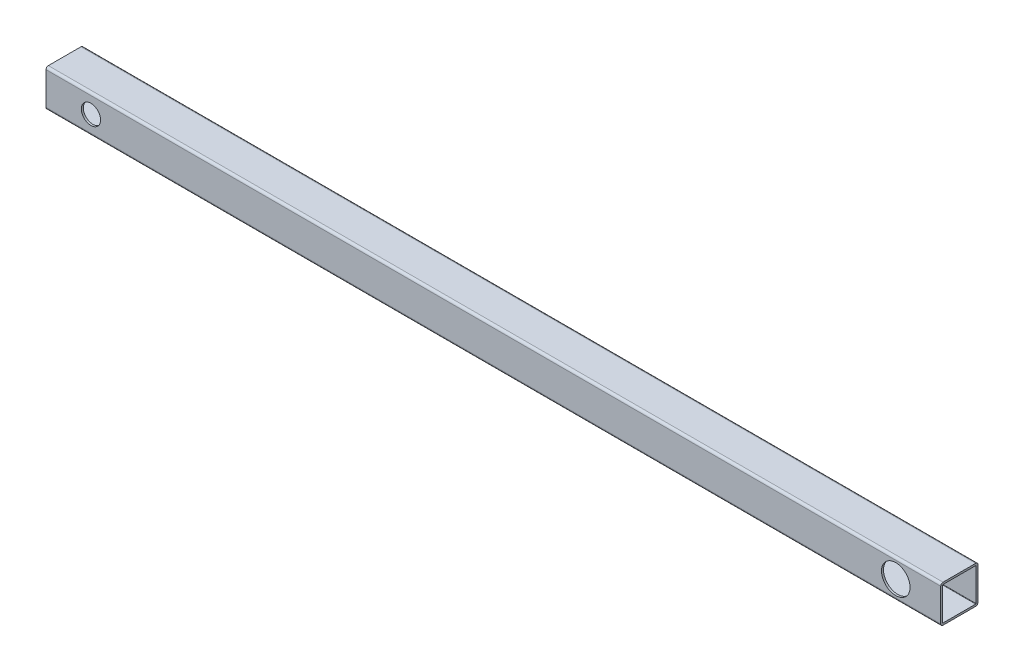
ISO-10303-21;
HEADER;
FILE_DESCRIPTION(('STEP AP214'),'2;1');
FILE_NAME('part.step','',(''),(''),'','','');
FILE_SCHEMA(('AUTOMOTIVE_DESIGN { 1 0 10303 214 1 1 1 1 }'));
ENDSEC;
DATA;
#1=APPLICATION_CONTEXT('core data for automotive mechanical design processes');
#2=APPLICATION_PROTOCOL_DEFINITION('international standard','automotive_design',2000,#1);
#3=PRODUCT_CONTEXT('',#1,'mechanical');
#4=PRODUCT('Part','Part','',(#3));
#5=PRODUCT_RELATED_PRODUCT_CATEGORY('part','',(#4));
#6=PRODUCT_DEFINITION_FORMATION('','',#4);
#7=PRODUCT_DEFINITION_CONTEXT('part definition',#1,'design');
#8=PRODUCT_DEFINITION('design','',#6,#7);
#9=PRODUCT_DEFINITION_SHAPE('','',#8);
#10=(LENGTH_UNIT() NAMED_UNIT(*) SI_UNIT(.MILLI.,.METRE.));
#11=(NAMED_UNIT(*) PLANE_ANGLE_UNIT() SI_UNIT($,.RADIAN.));
#12=(NAMED_UNIT(*) SI_UNIT($,.STERADIAN.) SOLID_ANGLE_UNIT());
#13=UNCERTAINTY_MEASURE_WITH_UNIT(LENGTH_MEASURE(1.E-05),#10,'distance_accuracy_value','');
#14=(GEOMETRIC_REPRESENTATION_CONTEXT(3) GLOBAL_UNCERTAINTY_ASSIGNED_CONTEXT((#13)) GLOBAL_UNIT_ASSIGNED_CONTEXT((#10,
#11,#12)) REPRESENTATION_CONTEXT('',''));
#15=CARTESIAN_POINT('',(0.,0.,0.));
#16=DIRECTION('',(0.,0.,1.));
#17=DIRECTION('',(1.,0.,0.));
#18=AXIS2_PLACEMENT_3D('',#15,#16,#17);
#19=CARTESIAN_POINT('',(609.6,3.65674086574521,-16.8519621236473));
#20=DIRECTION('',(-1.,0.,0.));
#21=DIRECTION('',(0.,0.,1.));
#22=AXIS2_PLACEMENT_3D('',#19,#20,#21);
#23=PLANE('',#22);
#24=CARTESIAN_POINT('',(609.6,3.65674086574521,-16.8519621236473));
#25=DIRECTION('',(1.,0.,0.));
#26=DIRECTION('',(0.,0.,1.));
#27=AXIS2_PLACEMENT_3D('',#24,#25,#26);
#28=CIRCLE('',#27,1.5875);
#29=CARTESIAN_POINT('',(609.6,3.6567408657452,-18.4394621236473));
#30=VERTEX_POINT('',#29);
#31=CARTESIAN_POINT('',(609.6,5.24424086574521,-16.8519621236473));
#32=VERTEX_POINT('',#31);
#33=EDGE_CURVE('E215',#30,#32,#28,.T.);
#34=ORIENTED_EDGE('',*,*,#33,.T.);
#35=DIRECTION('',(0.,0.,1.));
#36=VECTOR('',#35,1.);
#37=CARTESIAN_POINT('',(609.6,5.24424086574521,5.37303787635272));
#38=LINE('',#37,#36);
#39=CARTESIAN_POINT('',(609.6,5.24424086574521,5.37303787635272));
#40=VERTEX_POINT('',#39);
#41=EDGE_CURVE('E218',#32,#40,#38,.T.);
#42=ORIENTED_EDGE('',*,*,#41,.T.);
#43=CARTESIAN_POINT('',(609.6,3.65674086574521,5.37303787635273));
#44=DIRECTION('',(1.,0.,0.));
#45=DIRECTION('',(0.,0.,1.));
#46=AXIS2_PLACEMENT_3D('',#43,#44,#45);
#47=CIRCLE('',#46,1.5875);
#48=CARTESIAN_POINT('',(609.6,3.6567408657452,6.96053787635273));
#49=VERTEX_POINT('',#48);
#50=EDGE_CURVE('E221',#40,#49,#47,.T.);
#51=ORIENTED_EDGE('',*,*,#50,.T.);
#52=DIRECTION('',(0.,-1.,0.));
#53=VECTOR('',#52,1.);
#54=CARTESIAN_POINT('',(609.6,3.6567408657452,6.96053787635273));
#55=LINE('',#54,#53);
#56=CARTESIAN_POINT('',(609.6,-18.5682591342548,6.96053787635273));
#57=VERTEX_POINT('',#56);
#58=EDGE_CURVE('E223',#49,#57,#55,.T.);
#59=ORIENTED_EDGE('',*,*,#58,.T.);
#60=CARTESIAN_POINT('',(609.6,-18.5682591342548,5.37303787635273));
#61=DIRECTION('',(1.,0.,0.));
#62=DIRECTION('',(0.,0.,1.));
#63=AXIS2_PLACEMENT_3D('',#60,#61,#62);
#64=CIRCLE('',#63,1.5875);
#65=CARTESIAN_POINT('',(609.6,-20.1557591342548,5.37303787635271));
#66=VERTEX_POINT('',#65);
#67=EDGE_CURVE('E225',#57,#66,#64,.T.);
#68=ORIENTED_EDGE('',*,*,#67,.T.);
#69=DIRECTION('',(0.,0.,-1.));
#70=VECTOR('',#69,1.);
#71=CARTESIAN_POINT('',(609.6,-20.1557591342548,5.37303787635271));
#72=LINE('',#71,#70);
#73=CARTESIAN_POINT('',(609.6,-20.1557591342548,-16.8519621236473));
#74=VERTEX_POINT('',#73);
#75=EDGE_CURVE('E227',#66,#74,#72,.T.);
#76=ORIENTED_EDGE('',*,*,#75,.T.);
#77=CARTESIAN_POINT('',(609.6,-18.5682591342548,-16.8519621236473));
#78=DIRECTION('',(1.,0.,0.));
#79=DIRECTION('',(0.,0.,1.));
#80=AXIS2_PLACEMENT_3D('',#77,#78,#79);
#81=CIRCLE('',#80,1.5875);
#82=CARTESIAN_POINT('',(609.6,-18.5682591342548,-18.4394621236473));
#83=VERTEX_POINT('',#82);
#84=EDGE_CURVE('E229',#74,#83,#81,.T.);
#85=ORIENTED_EDGE('',*,*,#84,.T.);
#86=DIRECTION('',(0.,1.,0.));
#87=VECTOR('',#86,1.);
#88=CARTESIAN_POINT('',(609.6,3.6567408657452,-18.4394621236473));
#89=LINE('',#88,#87);
#90=EDGE_CURVE('E231',#83,#30,#89,.T.);
#91=ORIENTED_EDGE('',*,*,#90,.T.);
#92=EDGE_LOOP('',(#34,#42,#51,#59,#68,#76,#85,#91));
#93=FACE_BOUND('',#92,.T.);
#94=CARTESIAN_POINT('',(609.6,3.65674086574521,5.37303787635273));
#95=DIRECTION('',(1.,0.,0.));
#96=DIRECTION('',(0.,0.,1.));
#97=AXIS2_PLACEMENT_3D('',#94,#95,#96);
#98=CIRCLE('',#97,0.2413);
#99=CARTESIAN_POINT('',(609.6,3.89804086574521,5.37303787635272));
#100=VERTEX_POINT('',#99);
#101=CARTESIAN_POINT('',(609.6,3.6567408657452,5.61433787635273));
#102=VERTEX_POINT('',#101);
#103=EDGE_CURVE('E148',#100,#102,#98,.T.);
#104=ORIENTED_EDGE('',*,*,#103,.F.);
#105=DIRECTION('',(0.,0.,1.));
#106=VECTOR('',#105,1.);
#107=CARTESIAN_POINT('',(609.6,3.89804086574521,5.37303787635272));
#108=LINE('',#107,#106);
#109=CARTESIAN_POINT('',(609.6,3.89804086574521,-16.8519621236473));
#110=VERTEX_POINT('',#109);
#111=EDGE_CURVE('E182',#110,#100,#108,.T.);
#112=ORIENTED_EDGE('',*,*,#111,.F.);
#113=CARTESIAN_POINT('',(609.6,3.65674086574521,-16.8519621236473));
#114=DIRECTION('',(1.,0.,0.));
#115=DIRECTION('',(0.,0.,1.));
#116=AXIS2_PLACEMENT_3D('',#113,#114,#115);
#117=CIRCLE('',#116,0.2413);
#118=CARTESIAN_POINT('',(609.6,3.65674086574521,-17.0932621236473));
#119=VERTEX_POINT('',#118);
#120=EDGE_CURVE('E180',#119,#110,#117,.T.);
#121=ORIENTED_EDGE('',*,*,#120,.F.);
#122=DIRECTION('',(0.,1.,0.));
#123=VECTOR('',#122,1.);
#124=CARTESIAN_POINT('',(609.6,3.65674086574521,-17.0932621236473));
#125=LINE('',#124,#123);
#126=CARTESIAN_POINT('',(609.6,-18.5682591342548,-17.0932621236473));
#127=VERTEX_POINT('',#126);
#128=EDGE_CURVE('E178',#127,#119,#125,.T.);
#129=ORIENTED_EDGE('',*,*,#128,.F.);
#130=CARTESIAN_POINT('',(609.6,-18.5682591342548,-16.8519621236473));
#131=DIRECTION('',(1.,0.,0.));
#132=DIRECTION('',(0.,0.,1.));
#133=AXIS2_PLACEMENT_3D('',#130,#131,#132);
#134=CIRCLE('',#133,0.241299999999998);
#135=CARTESIAN_POINT('',(609.6,-18.8095591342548,-16.8519621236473));
#136=VERTEX_POINT('',#135);
#137=EDGE_CURVE('E176',#136,#127,#134,.T.);
#138=ORIENTED_EDGE('',*,*,#137,.F.);
#139=DIRECTION('',(0.,0.,-1.));
#140=VECTOR('',#139,1.);
#141=CARTESIAN_POINT('',(609.6,-18.8095591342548,5.37303787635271));
#142=LINE('',#141,#140);
#143=CARTESIAN_POINT('',(609.6,-18.8095591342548,5.37303787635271));
#144=VERTEX_POINT('',#143);
#145=EDGE_CURVE('E171',#144,#136,#142,.T.);
#146=ORIENTED_EDGE('',*,*,#145,.F.);
#147=CARTESIAN_POINT('',(609.6,-18.5682591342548,5.37303787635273));
#148=DIRECTION('',(1.,0.,0.));
#149=DIRECTION('',(0.,0.,1.));
#150=AXIS2_PLACEMENT_3D('',#147,#148,#149);
#151=CIRCLE('',#150,0.241299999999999);
#152=CARTESIAN_POINT('',(609.6,-18.5682591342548,5.61433787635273));
#153=VERTEX_POINT('',#152);
#154=EDGE_CURVE('E169',#153,#144,#151,.T.);
#155=ORIENTED_EDGE('',*,*,#154,.F.);
#156=DIRECTION('',(0.,-1.,0.));
#157=VECTOR('',#156,1.);
#158=CARTESIAN_POINT('',(609.6,3.6567408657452,5.61433787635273));
#159=LINE('',#158,#157);
#160=EDGE_CURVE('E156',#102,#153,#159,.T.);
#161=ORIENTED_EDGE('',*,*,#160,.F.);
#162=EDGE_LOOP('',(#104,#112,#121,#129,#138,#146,#155,#161));
#163=FACE_BOUND('',#162,.T.);
#164=ADVANCED_FACE('F33',(#93,#163),#23,.F.);
#165=CARTESIAN_POINT('',(0.,3.65674086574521,-16.8519621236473));
#166=DIRECTION('',(-1.,0.,0.));
#167=DIRECTION('',(0.,0.,1.));
#168=AXIS2_PLACEMENT_3D('',#165,#166,#167);
#169=PLANE('',#168);
#170=CARTESIAN_POINT('',(0.,3.65674086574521,-16.8519621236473));
#171=DIRECTION('',(1.,0.,0.));
#172=DIRECTION('',(0.,0.,1.));
#173=AXIS2_PLACEMENT_3D('',#170,#171,#172);
#174=CIRCLE('',#173,1.5875);
#175=CARTESIAN_POINT('',(0.,3.6567408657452,-18.4394621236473));
#176=VERTEX_POINT('',#175);
#177=CARTESIAN_POINT('',(0.,5.24424086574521,-16.8519621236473));
#178=VERTEX_POINT('',#177);
#179=EDGE_CURVE('E164',#176,#178,#174,.T.);
#180=ORIENTED_EDGE('',*,*,#179,.F.);
#181=DIRECTION('',(0.,1.,0.));
#182=VECTOR('',#181,1.);
#183=CARTESIAN_POINT('',(0.,3.6567408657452,-18.4394621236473));
#184=LINE('',#183,#182);
#185=CARTESIAN_POINT('',(0.,-18.5682591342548,-18.4394621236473));
#186=VERTEX_POINT('',#185);
#187=EDGE_CURVE('E219',#186,#176,#184,.T.);
#188=ORIENTED_EDGE('',*,*,#187,.F.);
#189=CARTESIAN_POINT('',(0.,-18.5682591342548,-16.8519621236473));
#190=DIRECTION('',(1.,0.,0.));
#191=DIRECTION('',(0.,0.,1.));
#192=AXIS2_PLACEMENT_3D('',#189,#190,#191);
#193=CIRCLE('',#192,1.5875);
#194=CARTESIAN_POINT('',(0.,-20.1557591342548,-16.8519621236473));
#195=VERTEX_POINT('',#194);
#196=EDGE_CURVE('E246',#195,#186,#193,.T.);
#197=ORIENTED_EDGE('',*,*,#196,.F.);
#198=DIRECTION('',(0.,0.,-1.));
#199=VECTOR('',#198,1.);
#200=CARTESIAN_POINT('',(0.,-20.1557591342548,5.37303787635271));
#201=LINE('',#200,#199);
#202=CARTESIAN_POINT('',(0.,-20.1557591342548,5.37303787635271));
#203=VERTEX_POINT('',#202);
#204=EDGE_CURVE('E244',#203,#195,#201,.T.);
#205=ORIENTED_EDGE('',*,*,#204,.F.);
#206=CARTESIAN_POINT('',(0.,-18.5682591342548,5.37303787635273));
#207=DIRECTION('',(1.,0.,0.));
#208=DIRECTION('',(0.,0.,1.));
#209=AXIS2_PLACEMENT_3D('',#206,#207,#208);
#210=CIRCLE('',#209,1.5875);
#211=CARTESIAN_POINT('',(0.,-18.5682591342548,6.96053787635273));
#212=VERTEX_POINT('',#211);
#213=EDGE_CURVE('E242',#212,#203,#210,.T.);
#214=ORIENTED_EDGE('',*,*,#213,.F.);
#215=DIRECTION('',(0.,-1.,0.));
#216=VECTOR('',#215,1.);
#217=CARTESIAN_POINT('',(0.,3.6567408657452,6.96053787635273));
#218=LINE('',#217,#216);
#219=CARTESIAN_POINT('',(0.,3.6567408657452,6.96053787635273));
#220=VERTEX_POINT('',#219);
#221=EDGE_CURVE('E240',#220,#212,#218,.T.);
#222=ORIENTED_EDGE('',*,*,#221,.F.);
#223=CARTESIAN_POINT('',(0.,3.65674086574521,5.37303787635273));
#224=DIRECTION('',(1.,0.,0.));
#225=DIRECTION('',(0.,0.,1.));
#226=AXIS2_PLACEMENT_3D('',#223,#224,#225);
#227=CIRCLE('',#226,1.5875);
#228=CARTESIAN_POINT('',(0.,5.24424086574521,5.37303787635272));
#229=VERTEX_POINT('',#228);
#230=EDGE_CURVE('E238',#229,#220,#227,.T.);
#231=ORIENTED_EDGE('',*,*,#230,.F.);
#232=DIRECTION('',(0.,0.,1.));
#233=VECTOR('',#232,1.);
#234=CARTESIAN_POINT('',(0.,5.24424086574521,5.37303787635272));
#235=LINE('',#234,#233);
#236=EDGE_CURVE('E236',#178,#229,#235,.T.);
#237=ORIENTED_EDGE('',*,*,#236,.F.);
#238=EDGE_LOOP('',(#180,#188,#197,#205,#214,#222,#231,#237));
#239=FACE_BOUND('',#238,.T.);
#240=DIRECTION('',(0.,0.,1.));
#241=VECTOR('',#240,1.);
#242=CARTESIAN_POINT('',(0.,3.89804086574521,5.37303787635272));
#243=LINE('',#242,#241);
#244=CARTESIAN_POINT('',(0.,3.89804086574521,-16.8519621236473));
#245=VERTEX_POINT('',#244);
#246=CARTESIAN_POINT('',(0.,3.89804086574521,5.37303787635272));
#247=VERTEX_POINT('',#246);
#248=EDGE_CURVE('E157',#245,#247,#243,.T.);
#249=ORIENTED_EDGE('',*,*,#248,.T.);
#250=CARTESIAN_POINT('',(0.,3.65674086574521,5.37303787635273));
#251=DIRECTION('',(1.,0.,0.));
#252=DIRECTION('',(0.,0.,1.));
#253=AXIS2_PLACEMENT_3D('',#250,#251,#252);
#254=CIRCLE('',#253,0.2413);
#255=CARTESIAN_POINT('',(0.,3.6567408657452,5.61433787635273));
#256=VERTEX_POINT('',#255);
#257=EDGE_CURVE('E58',#247,#256,#254,.T.);
#258=ORIENTED_EDGE('',*,*,#257,.T.);
#259=DIRECTION('',(0.,-1.,0.));
#260=VECTOR('',#259,1.);
#261=CARTESIAN_POINT('',(0.,3.6567408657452,5.61433787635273));
#262=LINE('',#261,#260);
#263=CARTESIAN_POINT('',(0.,-18.5682591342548,5.61433787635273));
#264=VERTEX_POINT('',#263);
#265=EDGE_CURVE('E163',#256,#264,#262,.T.);
#266=ORIENTED_EDGE('',*,*,#265,.T.);
#267=CARTESIAN_POINT('',(0.,-18.5682591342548,5.37303787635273));
#268=DIRECTION('',(1.,0.,0.));
#269=DIRECTION('',(0.,0.,1.));
#270=AXIS2_PLACEMENT_3D('',#267,#268,#269);
#271=CIRCLE('',#270,0.241299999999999);
#272=CARTESIAN_POINT('',(0.,-18.8095591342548,5.37303787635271));
#273=VERTEX_POINT('',#272);
#274=EDGE_CURVE('E187',#264,#273,#271,.T.);
#275=ORIENTED_EDGE('',*,*,#274,.T.);
#276=DIRECTION('',(0.,0.,-1.));
#277=VECTOR('',#276,1.);
#278=CARTESIAN_POINT('',(0.,-18.8095591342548,5.37303787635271));
#279=LINE('',#278,#277);
#280=CARTESIAN_POINT('',(0.,-18.8095591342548,-16.8519621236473));
#281=VERTEX_POINT('',#280);
#282=EDGE_CURVE('E190',#273,#281,#279,.T.);
#283=ORIENTED_EDGE('',*,*,#282,.T.);
#284=CARTESIAN_POINT('',(0.,-18.5682591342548,-16.8519621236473));
#285=DIRECTION('',(1.,0.,0.));
#286=DIRECTION('',(0.,0.,1.));
#287=AXIS2_PLACEMENT_3D('',#284,#285,#286);
#288=CIRCLE('',#287,0.241299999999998);
#289=CARTESIAN_POINT('',(0.,-18.5682591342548,-17.0932621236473));
#290=VERTEX_POINT('',#289);
#291=EDGE_CURVE('E193',#281,#290,#288,.T.);
#292=ORIENTED_EDGE('',*,*,#291,.T.);
#293=DIRECTION('',(0.,1.,0.));
#294=VECTOR('',#293,1.);
#295=CARTESIAN_POINT('',(0.,3.65674086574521,-17.0932621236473));
#296=LINE('',#295,#294);
#297=CARTESIAN_POINT('',(0.,3.65674086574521,-17.0932621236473));
#298=VERTEX_POINT('',#297);
#299=EDGE_CURVE('E196',#290,#298,#296,.T.);
#300=ORIENTED_EDGE('',*,*,#299,.T.);
#301=CARTESIAN_POINT('',(0.,3.65674086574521,-16.8519621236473));
#302=DIRECTION('',(1.,0.,0.));
#303=DIRECTION('',(0.,0.,1.));
#304=AXIS2_PLACEMENT_3D('',#301,#302,#303);
#305=CIRCLE('',#304,0.2413);
#306=EDGE_CURVE('E199',#298,#245,#305,.T.);
#307=ORIENTED_EDGE('',*,*,#306,.T.);
#308=EDGE_LOOP('',(#249,#258,#266,#275,#283,#292,#300,#307));
#309=FACE_BOUND('',#308,.T.);
#310=ADVANCED_FACE('F310',(#239,#309),#169,.T.);
#311=CARTESIAN_POINT('',(609.6,3.65674086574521,-16.8519621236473));
#312=DIRECTION('',(-1.,0.,0.));
#313=DIRECTION('',(0.,0.,1.));
#314=AXIS2_PLACEMENT_3D('',#311,#312,#313);
#315=CYLINDRICAL_SURFACE('',#314,1.5875);
#316=ORIENTED_EDGE('',*,*,#179,.T.);
#317=DIRECTION('',(-1.,0.,0.));
#318=VECTOR('',#317,1.);
#319=CARTESIAN_POINT('',(609.6,5.24424086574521,-16.8519621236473));
#320=LINE('',#319,#318);
#321=EDGE_CURVE('E11',#32,#178,#320,.T.);
#322=ORIENTED_EDGE('',*,*,#321,.F.);
#323=ORIENTED_EDGE('',*,*,#33,.F.);
#324=DIRECTION('',(-1.,0.,0.));
#325=VECTOR('',#324,1.);
#326=CARTESIAN_POINT('',(609.6,3.6567408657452,-18.4394621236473));
#327=LINE('',#326,#325);
#328=EDGE_CURVE('E233',#30,#176,#327,.T.);
#329=ORIENTED_EDGE('',*,*,#328,.T.);
#330=EDGE_LOOP('',(#316,#322,#323,#329));
#331=FACE_BOUND('',#330,.T.);
#332=ADVANCED_FACE('F35',(#331),#315,.T.);
#333=CARTESIAN_POINT('',(609.6,5.24424086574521,5.37303787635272));
#334=DIRECTION('',(0.,-1.,0.));
#335=DIRECTION('',(0.,0.,-1.));
#336=AXIS2_PLACEMENT_3D('',#333,#334,#335);
#337=PLANE('',#336);
#338=ORIENTED_EDGE('',*,*,#236,.T.);
#339=DIRECTION('',(-1.,0.,0.));
#340=VECTOR('',#339,1.);
#341=CARTESIAN_POINT('',(609.6,5.24424086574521,5.37303787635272));
#342=LINE('',#341,#340);
#343=EDGE_CURVE('E42',#40,#229,#342,.T.);
#344=ORIENTED_EDGE('',*,*,#343,.F.);
#345=ORIENTED_EDGE('',*,*,#41,.F.);
#346=ORIENTED_EDGE('',*,*,#321,.T.);
#347=EDGE_LOOP('',(#338,#344,#345,#346));
#348=FACE_BOUND('',#347,.T.);
#349=ADVANCED_FACE('F316',(#348),#337,.F.);
#350=CARTESIAN_POINT('',(609.6,3.65674086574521,5.37303787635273));
#351=DIRECTION('',(-1.,0.,0.));
#352=DIRECTION('',(0.,0.,1.));
#353=AXIS2_PLACEMENT_3D('',#350,#351,#352);
#354=CYLINDRICAL_SURFACE('',#353,1.5875);
#355=ORIENTED_EDGE('',*,*,#230,.T.);
#356=DIRECTION('',(-1.,0.,0.));
#357=VECTOR('',#356,1.);
#358=CARTESIAN_POINT('',(609.6,3.6567408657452,6.96053787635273));
#359=LINE('',#358,#357);
#360=EDGE_CURVE('E263',#49,#220,#359,.T.);
#361=ORIENTED_EDGE('',*,*,#360,.F.);
#362=ORIENTED_EDGE('',*,*,#50,.F.);
#363=ORIENTED_EDGE('',*,*,#343,.T.);
#364=EDGE_LOOP('',(#355,#361,#362,#363));
#365=FACE_BOUND('',#364,.T.);
#366=ADVANCED_FACE('F337',(#365),#354,.T.);
#367=CARTESIAN_POINT('',(609.6,3.6567408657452,6.96053787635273));
#368=DIRECTION('',(0.,0.,-1.));
#369=DIRECTION('',(0.,1.,0.));
#370=AXIS2_PLACEMENT_3D('',#367,#368,#369);
#371=PLANE('',#370);
#372=CARTESIAN_POINT('',(30.626294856,-7.45575913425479,6.96053787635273));
#373=DIRECTION('',(0.,0.,-1.));
#374=DIRECTION('',(0.,1.,0.));
#375=AXIS2_PLACEMENT_3D('',#372,#373,#374);
#376=CIRCLE('',#375,6.5484375);
#377=CARTESIAN_POINT('',(30.626294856,-0.907321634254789,6.96053787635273));
#378=VERTEX_POINT('',#377);
#379=EDGE_CURVE('E284',#378,#378,#376,.T.);
#380=ORIENTED_EDGE('',*,*,#379,.T.);
#381=EDGE_LOOP('',(#380));
#382=FACE_BOUND('',#381,.T.);
#383=CARTESIAN_POINT('',(578.973705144,-7.45575913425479,6.96053787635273));
#384=DIRECTION('',(0.,0.,-1.));
#385=DIRECTION('',(0.,1.,0.));
#386=AXIS2_PLACEMENT_3D('',#383,#384,#385);
#387=CIRCLE('',#386,9.72343750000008);
#388=CARTESIAN_POINT('',(578.973705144,2.26767836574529,6.96053787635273));
#389=VERTEX_POINT('',#388);
#390=EDGE_CURVE('E269',#389,#389,#387,.T.);
#391=ORIENTED_EDGE('',*,*,#390,.T.);
#392=EDGE_LOOP('',(#391));
#393=FACE_BOUND('',#392,.T.);
#394=ORIENTED_EDGE('',*,*,#221,.T.);
#395=DIRECTION('',(-1.,0.,0.));
#396=VECTOR('',#395,1.);
#397=CARTESIAN_POINT('',(609.6,-18.5682591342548,6.96053787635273));
#398=LINE('',#397,#396);
#399=EDGE_CURVE('E260',#57,#212,#398,.T.);
#400=ORIENTED_EDGE('',*,*,#399,.F.);
#401=ORIENTED_EDGE('',*,*,#58,.F.);
#402=ORIENTED_EDGE('',*,*,#360,.T.);
#403=EDGE_LOOP('',(#394,#400,#401,#402));
#404=FACE_BOUND('',#403,.T.);
#405=ADVANCED_FACE('F334',(#382,#393,#404),#371,.F.);
#406=CARTESIAN_POINT('',(609.6,-18.5682591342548,5.37303787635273));
#407=DIRECTION('',(-1.,0.,0.));
#408=DIRECTION('',(0.,0.,1.));
#409=AXIS2_PLACEMENT_3D('',#406,#407,#408);
#410=CYLINDRICAL_SURFACE('',#409,1.5875);
#411=ORIENTED_EDGE('',*,*,#213,.T.);
#412=DIRECTION('',(-1.,0.,0.));
#413=VECTOR('',#412,1.);
#414=CARTESIAN_POINT('',(609.6,-20.1557591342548,5.37303787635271));
#415=LINE('',#414,#413);
#416=EDGE_CURVE('E257',#66,#203,#415,.T.);
#417=ORIENTED_EDGE('',*,*,#416,.F.);
#418=ORIENTED_EDGE('',*,*,#67,.F.);
#419=ORIENTED_EDGE('',*,*,#399,.T.);
#420=EDGE_LOOP('',(#411,#417,#418,#419));
#421=FACE_BOUND('',#420,.T.);
#422=ADVANCED_FACE('F330',(#421),#410,.T.);
#423=CARTESIAN_POINT('',(609.6,-20.1557591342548,5.37303787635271));
#424=DIRECTION('',(0.,1.,0.));
#425=DIRECTION('',(0.,0.,1.));
#426=AXIS2_PLACEMENT_3D('',#423,#424,#425);
#427=PLANE('',#426);
#428=ORIENTED_EDGE('',*,*,#204,.T.);
#429=DIRECTION('',(-1.,0.,0.));
#430=VECTOR('',#429,1.);
#431=CARTESIAN_POINT('',(609.6,-20.1557591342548,-16.8519621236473));
#432=LINE('',#431,#430);
#433=EDGE_CURVE('E254',#74,#195,#432,.T.);
#434=ORIENTED_EDGE('',*,*,#433,.F.);
#435=ORIENTED_EDGE('',*,*,#75,.F.);
#436=ORIENTED_EDGE('',*,*,#416,.T.);
#437=EDGE_LOOP('',(#428,#434,#435,#436));
#438=FACE_BOUND('',#437,.T.);
#439=ADVANCED_FACE('F326',(#438),#427,.F.);
#440=CARTESIAN_POINT('',(609.6,-18.5682591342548,-16.8519621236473));
#441=DIRECTION('',(-1.,0.,0.));
#442=DIRECTION('',(0.,0.,1.));
#443=AXIS2_PLACEMENT_3D('',#440,#441,#442);
#444=CYLINDRICAL_SURFACE('',#443,1.5875);
#445=ORIENTED_EDGE('',*,*,#196,.T.);
#446=DIRECTION('',(-1.,0.,0.));
#447=VECTOR('',#446,1.);
#448=CARTESIAN_POINT('',(609.6,-18.5682591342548,-18.4394621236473));
#449=LINE('',#448,#447);
#450=EDGE_CURVE('E251',#83,#186,#449,.T.);
#451=ORIENTED_EDGE('',*,*,#450,.F.);
#452=ORIENTED_EDGE('',*,*,#84,.F.);
#453=ORIENTED_EDGE('',*,*,#433,.T.);
#454=EDGE_LOOP('',(#445,#451,#452,#453));
#455=FACE_BOUND('',#454,.T.);
#456=ADVANCED_FACE('F296',(#455),#444,.T.);
#457=CARTESIAN_POINT('',(609.6,3.6567408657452,-18.4394621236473));
#458=DIRECTION('',(0.,0.,1.));
#459=DIRECTION('',(0.,-1.,0.));
#460=AXIS2_PLACEMENT_3D('',#457,#458,#459);
#461=PLANE('',#460);
#462=CARTESIAN_POINT('',(30.626294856,-7.45575913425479,-18.4394621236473));
#463=DIRECTION('',(0.,0.,-1.));
#464=DIRECTION('',(0.,1.,0.));
#465=AXIS2_PLACEMENT_3D('',#462,#463,#464);
#466=CIRCLE('',#465,6.5484375);
#467=CARTESIAN_POINT('',(30.626294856,-0.907321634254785,-18.4394621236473));
#468=VERTEX_POINT('',#467);
#469=EDGE_CURVE('E287',#468,#468,#466,.T.);
#470=ORIENTED_EDGE('',*,*,#469,.F.);
#471=EDGE_LOOP('',(#470));
#472=FACE_BOUND('',#471,.T.);
#473=CARTESIAN_POINT('',(578.973705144,-7.45575913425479,-18.4394621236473));
#474=DIRECTION('',(0.,0.,-1.));
#475=DIRECTION('',(0.,1.,0.));
#476=AXIS2_PLACEMENT_3D('',#473,#474,#475);
#477=CIRCLE('',#476,9.72343750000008);
#478=CARTESIAN_POINT('',(578.973705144,2.2676783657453,-18.4394621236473));
#479=VERTEX_POINT('',#478);
#480=EDGE_CURVE('E274',#479,#479,#477,.T.);
#481=ORIENTED_EDGE('',*,*,#480,.F.);
#482=EDGE_LOOP('',(#481));
#483=FACE_BOUND('',#482,.T.);
#484=ORIENTED_EDGE('',*,*,#187,.T.);
#485=ORIENTED_EDGE('',*,*,#328,.F.);
#486=ORIENTED_EDGE('',*,*,#90,.F.);
#487=ORIENTED_EDGE('',*,*,#450,.T.);
#488=EDGE_LOOP('',(#484,#485,#486,#487));
#489=FACE_BOUND('',#488,.T.);
#490=ADVANCED_FACE('F293',(#472,#483,#489),#461,.F.);
#491=CARTESIAN_POINT('',(609.6,3.65674086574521,5.37303787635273));
#492=DIRECTION('',(-1.,0.,0.));
#493=DIRECTION('',(0.,0.,1.));
#494=AXIS2_PLACEMENT_3D('',#491,#492,#493);
#495=CYLINDRICAL_SURFACE('',#494,0.2413);
#496=ORIENTED_EDGE('',*,*,#257,.F.);
#497=DIRECTION('',(-1.,0.,0.));
#498=VECTOR('',#497,1.);
#499=CARTESIAN_POINT('',(609.6,3.89804086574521,5.37303787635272));
#500=LINE('',#499,#498);
#501=EDGE_CURVE('E152',#100,#247,#500,.T.);
#502=ORIENTED_EDGE('',*,*,#501,.F.);
#503=ORIENTED_EDGE('',*,*,#103,.T.);
#504=DIRECTION('',(-1.,0.,0.));
#505=VECTOR('',#504,1.);
#506=CARTESIAN_POINT('',(609.6,3.6567408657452,5.61433787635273));
#507=LINE('',#506,#505);
#508=EDGE_CURVE('E151',#102,#256,#507,.T.);
#509=ORIENTED_EDGE('',*,*,#508,.T.);
#510=EDGE_LOOP('',(#496,#502,#503,#509));
#511=FACE_BOUND('',#510,.T.);
#512=ADVANCED_FACE('F150',(#511),#495,.F.);
#513=CARTESIAN_POINT('',(609.6,3.6567408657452,5.61433787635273));
#514=DIRECTION('',(0.,0.,-1.));
#515=DIRECTION('',(0.,1.,0.));
#516=AXIS2_PLACEMENT_3D('',#513,#514,#515);
#517=PLANE('',#516);
#518=CARTESIAN_POINT('',(30.626294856,-7.45575913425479,5.61433787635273));
#519=DIRECTION('',(0.,0.,-1.));
#520=DIRECTION('',(0.,1.,0.));
#521=AXIS2_PLACEMENT_3D('',#518,#519,#520);
#522=CIRCLE('',#521,6.5484375);
#523=CARTESIAN_POINT('',(30.626294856,-0.907321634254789,5.61433787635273));
#524=VERTEX_POINT('',#523);
#525=EDGE_CURVE('E279',#524,#524,#522,.T.);
#526=ORIENTED_EDGE('',*,*,#525,.F.);
#527=EDGE_LOOP('',(#526));
#528=FACE_BOUND('',#527,.T.);
#529=CARTESIAN_POINT('',(578.973705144,-7.45575913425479,5.61433787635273));
#530=DIRECTION('',(0.,0.,-1.));
#531=DIRECTION('',(0.,1.,0.));
#532=AXIS2_PLACEMENT_3D('',#529,#530,#531);
#533=CIRCLE('',#532,9.72343750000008);
#534=CARTESIAN_POINT('',(578.973705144,2.26767836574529,5.61433787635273));
#535=VERTEX_POINT('',#534);
#536=EDGE_CURVE('E185',#535,#535,#533,.T.);
#537=ORIENTED_EDGE('',*,*,#536,.F.);
#538=EDGE_LOOP('',(#537));
#539=FACE_BOUND('',#538,.T.);
#540=ORIENTED_EDGE('',*,*,#265,.F.);
#541=ORIENTED_EDGE('',*,*,#508,.F.);
#542=ORIENTED_EDGE('',*,*,#160,.T.);
#543=DIRECTION('',(-1.,0.,0.));
#544=VECTOR('',#543,1.);
#545=CARTESIAN_POINT('',(609.6,-18.5682591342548,5.61433787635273));
#546=LINE('',#545,#544);
#547=EDGE_CURVE('E165',#153,#264,#546,.T.);
#548=ORIENTED_EDGE('',*,*,#547,.T.);
#549=EDGE_LOOP('',(#540,#541,#542,#548));
#550=FACE_BOUND('',#549,.T.);
#551=ADVANCED_FACE('F160',(#528,#539,#550),#517,.T.);
#552=CARTESIAN_POINT('',(609.6,-18.5682591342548,5.37303787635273));
#553=DIRECTION('',(-1.,0.,0.));
#554=DIRECTION('',(0.,0.,1.));
#555=AXIS2_PLACEMENT_3D('',#552,#553,#554);
#556=CYLINDRICAL_SURFACE('',#555,0.241299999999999);
#557=ORIENTED_EDGE('',*,*,#274,.F.);
#558=ORIENTED_EDGE('',*,*,#547,.F.);
#559=ORIENTED_EDGE('',*,*,#154,.T.);
#560=DIRECTION('',(-1.,0.,0.));
#561=VECTOR('',#560,1.);
#562=CARTESIAN_POINT('',(609.6,-18.8095591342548,5.37303787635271));
#563=LINE('',#562,#561);
#564=EDGE_CURVE('E212',#144,#273,#563,.T.);
#565=ORIENTED_EDGE('',*,*,#564,.T.);
#566=EDGE_LOOP('',(#557,#558,#559,#565));
#567=FACE_BOUND('',#566,.T.);
#568=ADVANCED_FACE('F388',(#567),#556,.F.);
#569=CARTESIAN_POINT('',(609.6,-18.8095591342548,5.37303787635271));
#570=DIRECTION('',(0.,1.,0.));
#571=DIRECTION('',(0.,0.,1.));
#572=AXIS2_PLACEMENT_3D('',#569,#570,#571);
#573=PLANE('',#572);
#574=ORIENTED_EDGE('',*,*,#282,.F.);
#575=ORIENTED_EDGE('',*,*,#564,.F.);
#576=ORIENTED_EDGE('',*,*,#145,.T.);
#577=DIRECTION('',(-1.,0.,0.));
#578=VECTOR('',#577,1.);
#579=CARTESIAN_POINT('',(609.6,-18.8095591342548,-16.8519621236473));
#580=LINE('',#579,#578);
#581=EDGE_CURVE('E210',#136,#281,#580,.T.);
#582=ORIENTED_EDGE('',*,*,#581,.T.);
#583=EDGE_LOOP('',(#574,#575,#576,#582));
#584=FACE_BOUND('',#583,.T.);
#585=ADVANCED_FACE('F395',(#584),#573,.T.);
#586=CARTESIAN_POINT('',(609.6,-18.5682591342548,-16.8519621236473));
#587=DIRECTION('',(-1.,0.,0.));
#588=DIRECTION('',(0.,0.,1.));
#589=AXIS2_PLACEMENT_3D('',#586,#587,#588);
#590=CYLINDRICAL_SURFACE('',#589,0.241299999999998);
#591=ORIENTED_EDGE('',*,*,#291,.F.);
#592=ORIENTED_EDGE('',*,*,#581,.F.);
#593=ORIENTED_EDGE('',*,*,#137,.T.);
#594=DIRECTION('',(-1.,0.,0.));
#595=VECTOR('',#594,1.);
#596=CARTESIAN_POINT('',(609.6,-18.5682591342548,-17.0932621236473));
#597=LINE('',#596,#595);
#598=EDGE_CURVE('E208',#127,#290,#597,.T.);
#599=ORIENTED_EDGE('',*,*,#598,.T.);
#600=EDGE_LOOP('',(#591,#592,#593,#599));
#601=FACE_BOUND('',#600,.T.);
#602=ADVANCED_FACE('F403',(#601),#590,.F.);
#603=CARTESIAN_POINT('',(609.6,3.65674086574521,-17.0932621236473));
#604=DIRECTION('',(0.,0.,1.));
#605=DIRECTION('',(1.,0.,0.));
#606=AXIS2_PLACEMENT_3D('',#603,#604,#605);
#607=PLANE('',#606);
#608=CARTESIAN_POINT('',(30.626294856,-7.45575913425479,-17.0932621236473));
#609=DIRECTION('',(0.,0.,1.));
#610=DIRECTION('',(1.,0.,0.));
#611=AXIS2_PLACEMENT_3D('',#608,#609,#610);
#612=CIRCLE('',#611,6.5484375);
#613=CARTESIAN_POINT('',(37.174732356,-7.45575913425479,-17.0932621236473));
#614=VERTEX_POINT('',#613);
#615=EDGE_CURVE('E37',#614,#614,#612,.T.);
#616=ORIENTED_EDGE('',*,*,#615,.F.);
#617=EDGE_LOOP('',(#616));
#618=FACE_BOUND('',#617,.T.);
#619=CARTESIAN_POINT('',(578.973705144,-7.45575913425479,-17.0932621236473));
#620=DIRECTION('',(0.,0.,1.));
#621=DIRECTION('',(1.,0.,0.));
#622=AXIS2_PLACEMENT_3D('',#619,#620,#621);
#623=CIRCLE('',#622,9.72343750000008);
#624=CARTESIAN_POINT('',(588.697142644,-7.45575913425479,-17.0932621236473));
#625=VERTEX_POINT('',#624);
#626=EDGE_CURVE('E267',#625,#625,#623,.T.);
#627=ORIENTED_EDGE('',*,*,#626,.F.);
#628=EDGE_LOOP('',(#627));
#629=FACE_BOUND('',#628,.T.);
#630=ORIENTED_EDGE('',*,*,#299,.F.);
#631=ORIENTED_EDGE('',*,*,#598,.F.);
#632=ORIENTED_EDGE('',*,*,#128,.T.);
#633=DIRECTION('',(-1.,0.,0.));
#634=VECTOR('',#633,1.);
#635=CARTESIAN_POINT('',(609.6,3.65674086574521,-17.0932621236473));
#636=LINE('',#635,#634);
#637=EDGE_CURVE('E206',#119,#298,#636,.T.);
#638=ORIENTED_EDGE('',*,*,#637,.T.);
#639=EDGE_LOOP('',(#630,#631,#632,#638));
#640=FACE_BOUND('',#639,.T.);
#641=ADVANCED_FACE('F411',(#618,#629,#640),#607,.T.);
#642=CARTESIAN_POINT('',(609.6,3.65674086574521,-16.8519621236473));
#643=DIRECTION('',(-1.,0.,0.));
#644=DIRECTION('',(0.,0.,1.));
#645=AXIS2_PLACEMENT_3D('',#642,#643,#644);
#646=CYLINDRICAL_SURFACE('',#645,0.2413);
#647=ORIENTED_EDGE('',*,*,#306,.F.);
#648=ORIENTED_EDGE('',*,*,#637,.F.);
#649=ORIENTED_EDGE('',*,*,#120,.T.);
#650=DIRECTION('',(-1.,0.,0.));
#651=VECTOR('',#650,1.);
#652=CARTESIAN_POINT('',(609.6,3.89804086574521,-16.8519621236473));
#653=LINE('',#652,#651);
#654=EDGE_CURVE('E50',#110,#245,#653,.T.);
#655=ORIENTED_EDGE('',*,*,#654,.T.);
#656=EDGE_LOOP('',(#647,#648,#649,#655));
#657=FACE_BOUND('',#656,.T.);
#658=ADVANCED_FACE('F419',(#657),#646,.F.);
#659=CARTESIAN_POINT('',(609.6,3.89804086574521,5.37303787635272));
#660=DIRECTION('',(0.,-1.,0.));
#661=DIRECTION('',(0.,0.,-1.));
#662=AXIS2_PLACEMENT_3D('',#659,#660,#661);
#663=PLANE('',#662);
#664=ORIENTED_EDGE('',*,*,#248,.F.);
#665=ORIENTED_EDGE('',*,*,#654,.F.);
#666=ORIENTED_EDGE('',*,*,#111,.T.);
#667=ORIENTED_EDGE('',*,*,#501,.T.);
#668=EDGE_LOOP('',(#664,#665,#666,#667));
#669=FACE_BOUND('',#668,.T.);
#670=ADVANCED_FACE('F427',(#669),#663,.T.);
#671=CARTESIAN_POINT('',(578.973705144,-7.45575913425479,6.96053787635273));
#672=DIRECTION('',(0.,0.,-1.));
#673=DIRECTION('',(0.,1.,0.));
#674=AXIS2_PLACEMENT_3D('',#671,#672,#673);
#675=CYLINDRICAL_SURFACE('',#674,9.72343750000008);
#676=ORIENTED_EDGE('',*,*,#626,.T.);
#677=EDGE_LOOP('',(#676));
#678=FACE_BOUND('',#677,.T.);
#679=ORIENTED_EDGE('',*,*,#480,.T.);
#680=EDGE_LOOP('',(#679));
#681=FACE_BOUND('',#680,.T.);
#682=ADVANCED_FACE('F435',(#678,#681),#675,.F.);
#683=ORIENTED_EDGE('',*,*,#536,.T.);
#684=EDGE_LOOP('',(#683));
#685=FACE_BOUND('',#684,.T.);
#686=ORIENTED_EDGE('',*,*,#390,.F.);
#687=EDGE_LOOP('',(#686));
#688=FACE_BOUND('',#687,.T.);
#689=ADVANCED_FACE('F441',(#685,#688),#675,.F.);
#690=CARTESIAN_POINT('',(30.626294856,-7.45575913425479,6.96053787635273));
#691=DIRECTION('',(0.,0.,-1.));
#692=DIRECTION('',(0.,1.,0.));
#693=AXIS2_PLACEMENT_3D('',#690,#691,#692);
#694=CYLINDRICAL_SURFACE('',#693,6.5484375);
#695=ORIENTED_EDGE('',*,*,#615,.T.);
#696=EDGE_LOOP('',(#695));
#697=FACE_BOUND('',#696,.T.);
#698=ORIENTED_EDGE('',*,*,#469,.T.);
#699=EDGE_LOOP('',(#698));
#700=FACE_BOUND('',#699,.T.);
#701=ADVANCED_FACE('F291',(#697,#700),#694,.F.);
#702=ORIENTED_EDGE('',*,*,#525,.T.);
#703=EDGE_LOOP('',(#702));
#704=FACE_BOUND('',#703,.T.);
#705=ORIENTED_EDGE('',*,*,#379,.F.);
#706=EDGE_LOOP('',(#705));
#707=FACE_BOUND('',#706,.T.);
#708=ADVANCED_FACE('F454',(#704,#707),#694,.F.);
#709=CLOSED_SHELL('',(#164,#310,#332,#349,#366,#405,#422,#439,#456,#490,#512,#551,#568,#585,
#602,#641,#658,#670,#682,#689,#701,#708));
#710=MANIFOLD_SOLID_BREP('B2',#709);
#711=ADVANCED_BREP_SHAPE_REPRESENTATION('',(#18,#710),#14);
#712=SHAPE_DEFINITION_REPRESENTATION(#9,#711);
ENDSEC;
END-ISO-10303-21;
